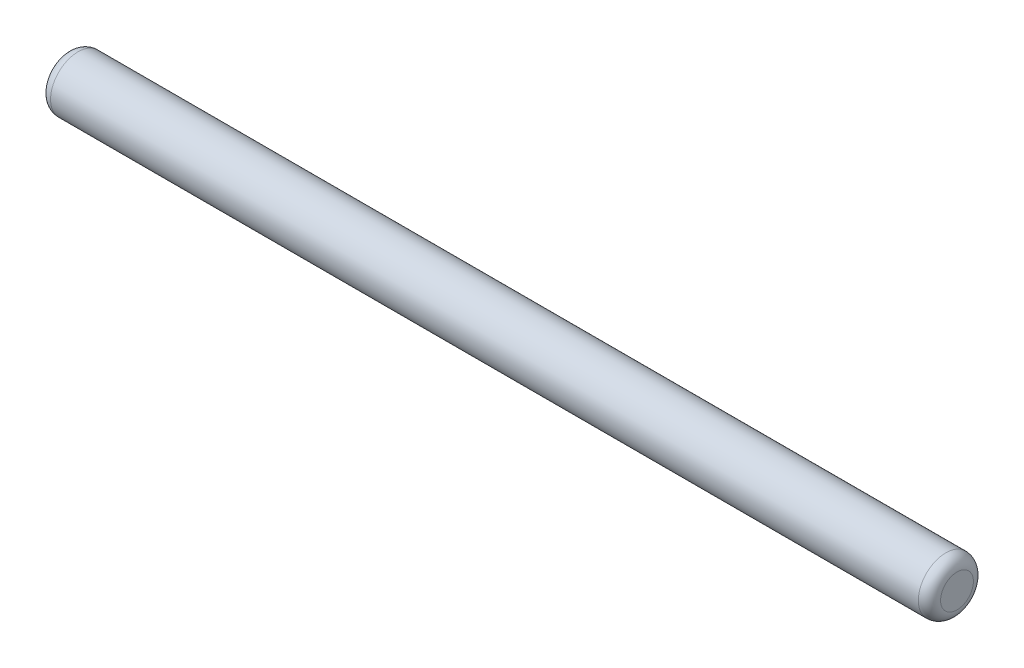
ISO-10303-21;
HEADER;
FILE_DESCRIPTION(('STEP AP214'),'2;1');
FILE_NAME('part.step','',(''),(''),'','','');
FILE_SCHEMA(('AUTOMOTIVE_DESIGN { 1 0 10303 214 1 1 1 1 }'));
ENDSEC;
DATA;
#1=APPLICATION_CONTEXT('core data for automotive mechanical design processes');
#2=APPLICATION_PROTOCOL_DEFINITION('international standard','automotive_design',2000,#1);
#3=PRODUCT_CONTEXT('',#1,'mechanical');
#4=PRODUCT('Part','Part','',(#3));
#5=PRODUCT_RELATED_PRODUCT_CATEGORY('part','',(#4));
#6=PRODUCT_DEFINITION_FORMATION('','',#4);
#7=PRODUCT_DEFINITION_CONTEXT('part definition',#1,'design');
#8=PRODUCT_DEFINITION('design','',#6,#7);
#9=PRODUCT_DEFINITION_SHAPE('','',#8);
#10=(LENGTH_UNIT() NAMED_UNIT(*) SI_UNIT(.MILLI.,.METRE.));
#11=(NAMED_UNIT(*) PLANE_ANGLE_UNIT() SI_UNIT($,.RADIAN.));
#12=(NAMED_UNIT(*) SI_UNIT($,.STERADIAN.) SOLID_ANGLE_UNIT());
#13=UNCERTAINTY_MEASURE_WITH_UNIT(LENGTH_MEASURE(1.E-05),#10,'distance_accuracy_value','');
#14=(GEOMETRIC_REPRESENTATION_CONTEXT(3) GLOBAL_UNCERTAINTY_ASSIGNED_CONTEXT((#13)) GLOBAL_UNIT_ASSIGNED_CONTEXT((#10,
#11,#12)) REPRESENTATION_CONTEXT('',''));
#15=CARTESIAN_POINT('',(0.,0.,0.));
#16=DIRECTION('',(0.,0.,1.));
#17=DIRECTION('',(1.,0.,0.));
#18=AXIS2_PLACEMENT_3D('',#15,#16,#17);
#19=CARTESIAN_POINT('',(101.6,0.,0.));
#20=DIRECTION('',(-1.,0.,0.));
#21=DIRECTION('',(0.,0.,1.));
#22=AXIS2_PLACEMENT_3D('',#19,#20,#21);
#23=CYLINDRICAL_SURFACE('',#22,6.2865);
#24=CARTESIAN_POINT('',(-99.06,0.,0.));
#25=DIRECTION('',(1.,0.,0.));
#26=DIRECTION('',(0.,0.,-1.));
#27=AXIS2_PLACEMENT_3D('',#24,#25,#26);
#28=CIRCLE('',#27,6.2865);
#29=CARTESIAN_POINT('',(-99.06,0.,-6.2865));
#30=VERTEX_POINT('',#29);
#31=EDGE_CURVE('E50',#30,#30,#28,.T.);
#32=ORIENTED_EDGE('',*,*,#31,.T.);
#33=EDGE_LOOP('',(#32));
#34=FACE_BOUND('',#33,.T.);
#35=CARTESIAN_POINT('',(99.06,0.,0.));
#36=DIRECTION('',(1.,0.,0.));
#37=DIRECTION('',(0.,0.,-1.));
#38=AXIS2_PLACEMENT_3D('',#35,#36,#37);
#39=CIRCLE('',#38,6.2865);
#40=CARTESIAN_POINT('',(99.06,0.,-6.2865));
#41=VERTEX_POINT('',#40);
#42=EDGE_CURVE('E54',#41,#41,#39,.F.);
#43=ORIENTED_EDGE('',*,*,#42,.T.);
#44=EDGE_LOOP('',(#43));
#45=FACE_BOUND('',#44,.T.);
#46=ADVANCED_FACE('F39',(#34,#45),#23,.T.);
#47=CARTESIAN_POINT('',(101.6,0.,0.));
#48=DIRECTION('',(1.,0.,0.));
#49=DIRECTION('',(0.,0.,-1.));
#50=AXIS2_PLACEMENT_3D('',#47,#48,#49);
#51=PLANE('',#50);
#52=CARTESIAN_POINT('',(101.6,0.,0.));
#53=DIRECTION('',(1.,0.,0.));
#54=DIRECTION('',(0.,0.,-1.));
#55=AXIS2_PLACEMENT_3D('',#52,#53,#54);
#56=CIRCLE('',#55,3.7465);
#57=CARTESIAN_POINT('',(101.6,0.,-3.7465));
#58=VERTEX_POINT('',#57);
#59=EDGE_CURVE('E10',#58,#58,#56,.T.);
#60=ORIENTED_EDGE('',*,*,#59,.T.);
#61=EDGE_LOOP('',(#60));
#62=FACE_BOUND('',#61,.T.);
#63=ADVANCED_FACE('F70',(#62),#51,.T.);
#64=CARTESIAN_POINT('',(-101.6,0.,0.));
#65=DIRECTION('',(1.,0.,0.));
#66=DIRECTION('',(0.,0.,-1.));
#67=AXIS2_PLACEMENT_3D('',#64,#65,#66);
#68=PLANE('',#67);
#69=CARTESIAN_POINT('',(-101.6,0.,0.));
#70=DIRECTION('',(1.,0.,0.));
#71=DIRECTION('',(0.,0.,-1.));
#72=AXIS2_PLACEMENT_3D('',#69,#70,#71);
#73=CIRCLE('',#72,3.7465);
#74=CARTESIAN_POINT('',(-101.6,0.,-3.7465));
#75=VERTEX_POINT('',#74);
#76=EDGE_CURVE('E46',#75,#75,#73,.F.);
#77=ORIENTED_EDGE('',*,*,#76,.T.);
#78=EDGE_LOOP('',(#77));
#79=FACE_BOUND('',#78,.T.);
#80=ADVANCED_FACE('F67',(#79),#68,.F.);
#81=CARTESIAN_POINT('',(-99.06,0.,0.));
#82=DIRECTION('',(1.,0.,0.));
#83=DIRECTION('',(0.,0.,-1.));
#84=AXIS2_PLACEMENT_3D('',#81,#82,#83);
#85=TOROIDAL_SURFACE('',#84,3.7465,2.54);
#86=ORIENTED_EDGE('',*,*,#76,.F.);
#87=EDGE_LOOP('',(#86));
#88=FACE_BOUND('',#87,.T.);
#89=ORIENTED_EDGE('',*,*,#31,.F.);
#90=EDGE_LOOP('',(#89));
#91=FACE_BOUND('',#90,.T.);
#92=ADVANCED_FACE('F63',(#88,#91),#85,.T.);
#93=CARTESIAN_POINT('',(99.06,0.,0.));
#94=DIRECTION('',(1.,0.,0.));
#95=DIRECTION('',(0.,0.,-1.));
#96=AXIS2_PLACEMENT_3D('',#93,#94,#95);
#97=TOROIDAL_SURFACE('',#96,3.7465,2.54);
#98=ORIENTED_EDGE('',*,*,#42,.F.);
#99=EDGE_LOOP('',(#98));
#100=FACE_BOUND('',#99,.T.);
#101=ORIENTED_EDGE('',*,*,#59,.F.);
#102=EDGE_LOOP('',(#101));
#103=FACE_BOUND('',#102,.T.);
#104=ADVANCED_FACE('F41',(#100,#103),#97,.T.);
#105=CLOSED_SHELL('',(#46,#63,#80,#92,#104));
#106=MANIFOLD_SOLID_BREP('B2',#105);
#107=ADVANCED_BREP_SHAPE_REPRESENTATION('',(#18,#106),#14);
#108=SHAPE_DEFINITION_REPRESENTATION(#9,#107);
ENDSEC;
END-ISO-10303-21;
